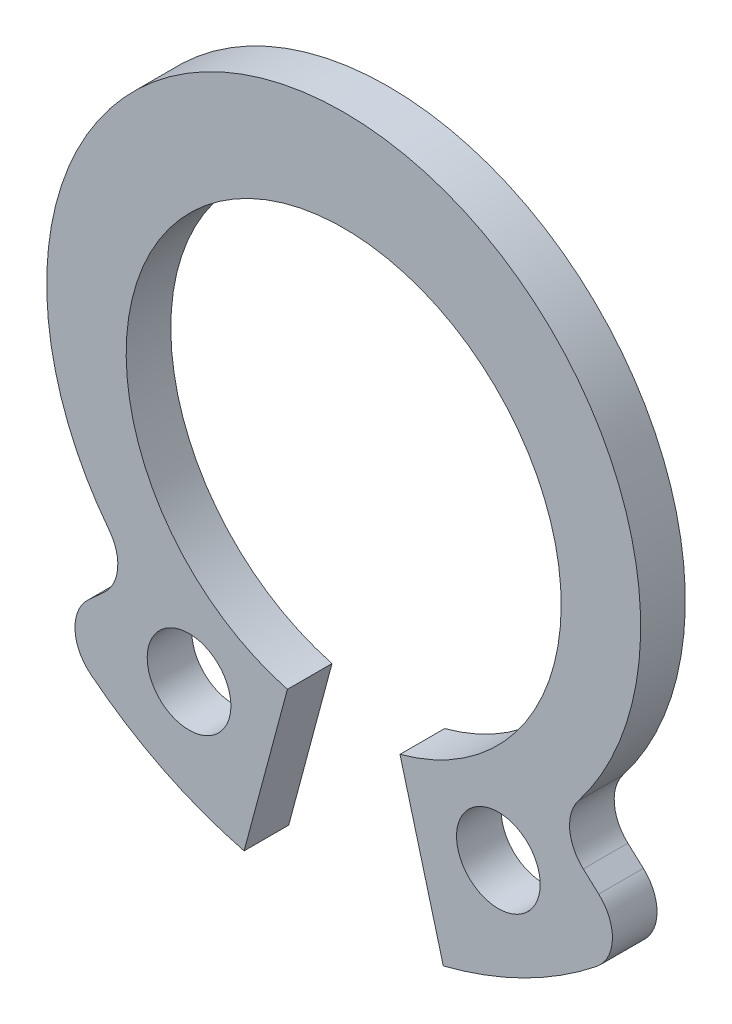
ISO-10303-21;
HEADER;
FILE_DESCRIPTION(('STEP AP214'),'2;1');
FILE_NAME('part.step','',(''),(''),'','','');
FILE_SCHEMA(('AUTOMOTIVE_DESIGN { 1 0 10303 214 1 1 1 1 }'));
ENDSEC;
DATA;
#1=APPLICATION_CONTEXT('core data for automotive mechanical design processes');
#2=APPLICATION_PROTOCOL_DEFINITION('international standard','automotive_design',2000,#1);
#3=PRODUCT_CONTEXT('',#1,'mechanical');
#4=PRODUCT('Part','Part','',(#3));
#5=PRODUCT_RELATED_PRODUCT_CATEGORY('part','',(#4));
#6=PRODUCT_DEFINITION_FORMATION('','',#4);
#7=PRODUCT_DEFINITION_CONTEXT('part definition',#1,'design');
#8=PRODUCT_DEFINITION('design','',#6,#7);
#9=PRODUCT_DEFINITION_SHAPE('','',#8);
#10=(LENGTH_UNIT() NAMED_UNIT(*) SI_UNIT(.MILLI.,.METRE.));
#11=(NAMED_UNIT(*) PLANE_ANGLE_UNIT() SI_UNIT($,.RADIAN.));
#12=(NAMED_UNIT(*) SI_UNIT($,.STERADIAN.) SOLID_ANGLE_UNIT());
#13=UNCERTAINTY_MEASURE_WITH_UNIT(LENGTH_MEASURE(1.E-05),#10,'distance_accuracy_value','');
#14=(GEOMETRIC_REPRESENTATION_CONTEXT(3) GLOBAL_UNCERTAINTY_ASSIGNED_CONTEXT((#13)) GLOBAL_UNIT_ASSIGNED_CONTEXT((#10,
#11,#12)) REPRESENTATION_CONTEXT('',''));
#15=CARTESIAN_POINT('',(0.,0.,0.));
#16=DIRECTION('',(0.,0.,1.));
#17=DIRECTION('',(1.,0.,0.));
#18=AXIS2_PLACEMENT_3D('',#15,#16,#17);
#19=CARTESIAN_POINT('',(-4.79991390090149,-3.34876846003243,0.799999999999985));
#20=DIRECTION('',(0.,0.,-1.));
#21=DIRECTION('',(-1.,0.,0.));
#22=AXIS2_PLACEMENT_3D('',#19,#20,#21);
#23=PLANE('',#22);
#24=CARTESIAN_POINT('',(2.77313372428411,-4.53181244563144,0.799999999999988));
#25=DIRECTION('',(0.,0.,1.));
#26=DIRECTION('',(1.,0.,0.));
#27=AXIS2_PLACEMENT_3D('',#24,#25,#26);
#28=CIRCLE('',#27,0.75);
#29=CARTESIAN_POINT('',(3.52313372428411,-4.53181244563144,0.799999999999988));
#30=VERTEX_POINT('',#29);
#31=EDGE_CURVE('E139',#30,#30,#28,.T.);
#32=ORIENTED_EDGE('',*,*,#31,.F.);
#33=EDGE_LOOP('',(#32));
#34=FACE_BOUND('',#33,.T.);
#35=CARTESIAN_POINT('',(-4.79991390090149,-3.34876846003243,0.799999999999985));
#36=DIRECTION('',(0.,0.,-1.));
#37=DIRECTION('',(-1.,0.,0.));
#38=AXIS2_PLACEMENT_3D('',#35,#36,#37);
#39=CIRCLE('',#38,0.750000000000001);
#40=CARTESIAN_POINT('',(-4.20733193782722,-2.88904395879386,0.799999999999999));
#41=VERTEX_POINT('',#40);
#42=CARTESIAN_POINT('',(-4.29549378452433,-3.90380030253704,0.799999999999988));
#43=VERTEX_POINT('',#42);
#44=EDGE_CURVE('E165',#41,#43,#39,.T.);
#45=ORIENTED_EDGE('',*,*,#44,.T.);
#46=DIRECTION('',(-0.740042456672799,-0.672560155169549,0.));
#47=VECTOR('',#46,1.);
#48=CARTESIAN_POINT('',(-4.29549378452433,-3.90380030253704,0.799999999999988));
#49=LINE('',#48,#47);
#50=CARTESIAN_POINT('',(-4.5727932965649,-4.15581368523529,0.799999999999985));
#51=VERTEX_POINT('',#50);
#52=EDGE_CURVE('E134',#43,#51,#49,.T.);
#53=ORIENTED_EDGE('',*,*,#52,.T.);
#54=CARTESIAN_POINT('',(-4.06837318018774,-4.7108455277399,0.799999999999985));
#55=DIRECTION('',(0.,0.,1.));
#56=DIRECTION('',(-1.,0.,0.));
#57=AXIS2_PLACEMENT_3D('',#54,#55,#56);
#58=CIRCLE('',#57,0.75);
#59=CARTESIAN_POINT('',(-4.53687317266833,-5.29651416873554,0.799999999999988));
#60=VERTEX_POINT('',#59);
#61=EDGE_CURVE('E168',#51,#60,#58,.T.);
#62=ORIENTED_EDGE('',*,*,#61,.T.);
#63=CARTESIAN_POINT('',(0.,0.375000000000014,0.799999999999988));
#64=DIRECTION('',(0.,0.,1.));
#65=DIRECTION('',(1.,0.,0.));
#66=AXIS2_PLACEMENT_3D('',#63,#64,#65);
#67=CIRCLE('',#66,7.26287072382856);
#68=CARTESIAN_POINT('',(-1.78585141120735,-6.66488820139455,0.799999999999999));
#69=VERTEX_POINT('',#68);
#70=EDGE_CURVE('E170',#60,#69,#67,.T.);
#71=ORIENTED_EDGE('',*,*,#70,.T.);
#72=DIRECTION('',(0.258819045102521,0.965925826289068,0.));
#73=VECTOR('',#72,1.);
#74=CARTESIAN_POINT('',(-1.00939427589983,-3.76711072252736,0.799999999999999));
#75=LINE('',#74,#73);
#76=CARTESIAN_POINT('',(-1.00939427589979,-3.76711072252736,0.799999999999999));
#77=VERTEX_POINT('',#76);
#78=EDGE_CURVE('E172',#69,#77,#75,.T.);
#79=ORIENTED_EDGE('',*,*,#78,.T.);
#80=CARTESIAN_POINT('',(0.,0.,0.799999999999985));
#81=DIRECTION('',(0.,0.,-1.));
#82=DIRECTION('',(1.,0.,0.));
#83=AXIS2_PLACEMENT_3D('',#80,#81,#82);
#84=CIRCLE('',#83,3.9);
#85=CARTESIAN_POINT('',(1.00939427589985,-3.76711072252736,0.799999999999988));
#86=VERTEX_POINT('',#85);
#87=EDGE_CURVE('E174',#77,#86,#84,.T.);
#88=ORIENTED_EDGE('',*,*,#87,.T.);
#89=DIRECTION('',(0.258819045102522,-0.965925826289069,0.));
#90=VECTOR('',#89,1.);
#91=CARTESIAN_POINT('',(1.00939427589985,-3.76711072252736,0.799999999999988));
#92=LINE('',#91,#90);
#93=CARTESIAN_POINT('',(1.78585141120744,-6.66488820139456,0.799999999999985));
#94=VERTEX_POINT('',#93);
#95=EDGE_CURVE('E176',#86,#94,#92,.T.);
#96=ORIENTED_EDGE('',*,*,#95,.T.);
#97=CARTESIAN_POINT('',(0.,0.375000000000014,0.799999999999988));
#98=DIRECTION('',(0.,0.,1.));
#99=DIRECTION('',(1.,0.,0.));
#100=AXIS2_PLACEMENT_3D('',#97,#98,#99);
#101=CIRCLE('',#100,7.26287072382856);
#102=CARTESIAN_POINT('',(4.53687317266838,-5.29651416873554,0.799999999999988));
#103=VERTEX_POINT('',#102);
#104=EDGE_CURVE('E178',#94,#103,#101,.T.);
#105=ORIENTED_EDGE('',*,*,#104,.T.);
#106=CARTESIAN_POINT('',(4.06837318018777,-4.7108455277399,0.799999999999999));
#107=DIRECTION('',(0.,0.,1.));
#108=DIRECTION('',(1.,0.,0.));
#109=AXIS2_PLACEMENT_3D('',#106,#107,#108);
#110=CIRCLE('',#109,0.75);
#111=CARTESIAN_POINT('',(4.57279329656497,-4.15581368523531,0.799999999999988));
#112=VERTEX_POINT('',#111);
#113=EDGE_CURVE('E180',#103,#112,#110,.T.);
#114=ORIENTED_EDGE('',*,*,#113,.T.);
#115=DIRECTION('',(-0.7400424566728,0.67256015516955,0.));
#116=VECTOR('',#115,1.);
#117=CARTESIAN_POINT('',(4.29549378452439,-3.90380030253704,0.799999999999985));
#118=LINE('',#117,#116);
#119=CARTESIAN_POINT('',(4.29549378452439,-3.90380030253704,0.799999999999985));
#120=VERTEX_POINT('',#119);
#121=EDGE_CURVE('E182',#112,#120,#118,.T.);
#122=ORIENTED_EDGE('',*,*,#121,.T.);
#123=CARTESIAN_POINT('',(4.79991390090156,-3.34876846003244,0.799999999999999));
#124=DIRECTION('',(0.,0.,-1.));
#125=DIRECTION('',(1.,0.,0.));
#126=AXIS2_PLACEMENT_3D('',#123,#124,#125);
#127=CIRCLE('',#126,0.750000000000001);
#128=CARTESIAN_POINT('',(4.20733193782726,-2.88904395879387,0.799999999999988));
#129=VERTEX_POINT('',#128);
#130=EDGE_CURVE('E51',#120,#129,#127,.T.);
#131=ORIENTED_EDGE('',*,*,#130,.T.);
#132=CARTESIAN_POINT('',(0.,0.375000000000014,0.799999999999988));
#133=DIRECTION('',(0.,0.,1.));
#134=DIRECTION('',(1.,0.,0.));
#135=AXIS2_PLACEMENT_3D('',#132,#133,#134);
#136=CIRCLE('',#135,5.325);
#137=EDGE_CURVE('E46',#129,#41,#136,.T.);
#138=ORIENTED_EDGE('',*,*,#137,.T.);
#139=EDGE_LOOP('',(#45,#53,#62,#71,#79,#88,#96,#105,#114,#122,#131,#138));
#140=FACE_BOUND('',#139,.T.);
#141=CARTESIAN_POINT('',(-2.77313372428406,-4.53181244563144,0.799999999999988));
#142=DIRECTION('',(0.,0.,1.));
#143=DIRECTION('',(-1.,0.,0.));
#144=AXIS2_PLACEMENT_3D('',#141,#142,#143);
#145=CIRCLE('',#144,0.75);
#146=CARTESIAN_POINT('',(-3.52313372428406,-4.53181244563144,0.799999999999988));
#147=VERTEX_POINT('',#146);
#148=EDGE_CURVE('E285',#147,#147,#145,.T.);
#149=ORIENTED_EDGE('',*,*,#148,.F.);
#150=EDGE_LOOP('',(#149));
#151=FACE_BOUND('',#150,.T.);
#152=ADVANCED_FACE('F31',(#34,#140,#151),#23,.F.);
#153=CARTESIAN_POINT('',(-4.79991390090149,-3.34876846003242,0.));
#154=DIRECTION('',(0.,0.,-1.));
#155=DIRECTION('',(-1.,0.,0.));
#156=AXIS2_PLACEMENT_3D('',#153,#154,#155);
#157=PLANE('',#156);
#158=CARTESIAN_POINT('',(2.7731337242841,-4.53181244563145,0.));
#159=DIRECTION('',(0.,0.,1.));
#160=DIRECTION('',(1.,0.,0.));
#161=AXIS2_PLACEMENT_3D('',#158,#159,#160);
#162=CIRCLE('',#161,0.75);
#163=CARTESIAN_POINT('',(3.5231337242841,-4.53181244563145,0.));
#164=VERTEX_POINT('',#163);
#165=EDGE_CURVE('E142',#164,#164,#162,.T.);
#166=ORIENTED_EDGE('',*,*,#165,.T.);
#167=EDGE_LOOP('',(#166));
#168=FACE_BOUND('',#167,.T.);
#169=CARTESIAN_POINT('',(-4.79991390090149,-3.34876846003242,0.));
#170=DIRECTION('',(0.,0.,-1.));
#171=DIRECTION('',(-1.,0.,0.));
#172=AXIS2_PLACEMENT_3D('',#169,#170,#171);
#173=CIRCLE('',#172,0.750000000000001);
#174=CARTESIAN_POINT('',(-4.20733193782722,-2.88904395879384,0.));
#175=VERTEX_POINT('',#174);
#176=CARTESIAN_POINT('',(-4.29549378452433,-3.90380030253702,0.));
#177=VERTEX_POINT('',#176);
#178=EDGE_CURVE('E125',#175,#177,#173,.T.);
#179=ORIENTED_EDGE('',*,*,#178,.F.);
#180=CARTESIAN_POINT('',(0.,0.375000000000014,0.));
#181=DIRECTION('',(0.,0.,1.));
#182=DIRECTION('',(1.,0.,0.));
#183=AXIS2_PLACEMENT_3D('',#180,#181,#182);
#184=CIRCLE('',#183,5.325);
#185=CARTESIAN_POINT('',(4.20733193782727,-2.88904395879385,0.));
#186=VERTEX_POINT('',#185);
#187=EDGE_CURVE('E163',#186,#175,#184,.T.);
#188=ORIENTED_EDGE('',*,*,#187,.F.);
#189=CARTESIAN_POINT('',(4.79991390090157,-3.34876846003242,0.));
#190=DIRECTION('',(0.,0.,-1.));
#191=DIRECTION('',(1.,0.,0.));
#192=AXIS2_PLACEMENT_3D('',#189,#190,#191);
#193=CIRCLE('',#192,0.750000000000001);
#194=CARTESIAN_POINT('',(4.29549378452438,-3.90380030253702,0.));
#195=VERTEX_POINT('',#194);
#196=EDGE_CURVE('E161',#195,#186,#193,.T.);
#197=ORIENTED_EDGE('',*,*,#196,.F.);
#198=DIRECTION('',(-0.7400424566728,0.67256015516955,0.));
#199=VECTOR('',#198,1.);
#200=CARTESIAN_POINT('',(4.29549378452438,-3.90380030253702,0.));
#201=LINE('',#200,#199);
#202=CARTESIAN_POINT('',(4.57279329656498,-4.1558136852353,0.));
#203=VERTEX_POINT('',#202);
#204=EDGE_CURVE('E159',#203,#195,#201,.T.);
#205=ORIENTED_EDGE('',*,*,#204,.F.);
#206=CARTESIAN_POINT('',(4.06837318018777,-4.7108455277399,0.));
#207=DIRECTION('',(0.,0.,1.));
#208=DIRECTION('',(1.,0.,0.));
#209=AXIS2_PLACEMENT_3D('',#206,#207,#208);
#210=CIRCLE('',#209,0.75);
#211=CARTESIAN_POINT('',(4.53687317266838,-5.29651416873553,0.));
#212=VERTEX_POINT('',#211);
#213=EDGE_CURVE('E157',#212,#203,#210,.T.);
#214=ORIENTED_EDGE('',*,*,#213,.F.);
#215=CARTESIAN_POINT('',(0.,0.375000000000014,0.));
#216=DIRECTION('',(0.,0.,1.));
#217=DIRECTION('',(1.,0.,0.));
#218=AXIS2_PLACEMENT_3D('',#215,#216,#217);
#219=CIRCLE('',#218,7.26287072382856);
#220=CARTESIAN_POINT('',(1.78585141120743,-6.66488820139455,0.));
#221=VERTEX_POINT('',#220);
#222=EDGE_CURVE('E155',#221,#212,#219,.T.);
#223=ORIENTED_EDGE('',*,*,#222,.F.);
#224=DIRECTION('',(0.258819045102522,-0.965925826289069,0.));
#225=VECTOR('',#224,1.);
#226=CARTESIAN_POINT('',(1.00939427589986,-3.76711072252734,0.));
#227=LINE('',#226,#225);
#228=CARTESIAN_POINT('',(1.00939427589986,-3.76711072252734,0.));
#229=VERTEX_POINT('',#228);
#230=EDGE_CURVE('E153',#229,#221,#227,.T.);
#231=ORIENTED_EDGE('',*,*,#230,.F.);
#232=CARTESIAN_POINT('',(0.,0.,0.));
#233=DIRECTION('',(0.,0.,-1.));
#234=DIRECTION('',(1.,0.,0.));
#235=AXIS2_PLACEMENT_3D('',#232,#233,#234);
#236=CIRCLE('',#235,3.9);
#237=CARTESIAN_POINT('',(-1.00939427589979,-3.76711072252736,0.));
#238=VERTEX_POINT('',#237);
#239=EDGE_CURVE('E151',#238,#229,#236,.T.);
#240=ORIENTED_EDGE('',*,*,#239,.F.);
#241=DIRECTION('',(0.258819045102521,0.965925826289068,0.));
#242=VECTOR('',#241,1.);
#243=CARTESIAN_POINT('',(-1.00939427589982,-3.76711072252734,0.));
#244=LINE('',#243,#242);
#245=CARTESIAN_POINT('',(-1.78585141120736,-6.66488820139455,0.));
#246=VERTEX_POINT('',#245);
#247=EDGE_CURVE('E149',#246,#238,#244,.T.);
#248=ORIENTED_EDGE('',*,*,#247,.F.);
#249=CARTESIAN_POINT('',(0.,0.375000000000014,0.));
#250=DIRECTION('',(0.,0.,1.));
#251=DIRECTION('',(1.,0.,0.));
#252=AXIS2_PLACEMENT_3D('',#249,#250,#251);
#253=CIRCLE('',#252,7.26287072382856);
#254=CARTESIAN_POINT('',(-4.53687317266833,-5.29651416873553,0.));
#255=VERTEX_POINT('',#254);
#256=EDGE_CURVE('E147',#255,#246,#253,.T.);
#257=ORIENTED_EDGE('',*,*,#256,.F.);
#258=CARTESIAN_POINT('',(-4.06837318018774,-4.7108455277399,0.));
#259=DIRECTION('',(0.,0.,1.));
#260=DIRECTION('',(-1.,0.,0.));
#261=AXIS2_PLACEMENT_3D('',#258,#259,#260);
#262=CIRCLE('',#261,0.75);
#263=CARTESIAN_POINT('',(-4.5727932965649,-4.15581368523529,0.));
#264=VERTEX_POINT('',#263);
#265=EDGE_CURVE('E127',#264,#255,#262,.T.);
#266=ORIENTED_EDGE('',*,*,#265,.F.);
#267=DIRECTION('',(-0.740042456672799,-0.672560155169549,0.));
#268=VECTOR('',#267,1.);
#269=CARTESIAN_POINT('',(-4.29549378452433,-3.90380030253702,0.));
#270=LINE('',#269,#268);
#271=EDGE_CURVE('E120',#177,#264,#270,.T.);
#272=ORIENTED_EDGE('',*,*,#271,.F.);
#273=EDGE_LOOP('',(#179,#188,#197,#205,#214,#223,#231,#240,#248,#257,#266,#272));
#274=FACE_BOUND('',#273,.T.);
#275=CARTESIAN_POINT('',(-2.77313372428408,-4.53181244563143,0.));
#276=DIRECTION('',(0.,0.,1.));
#277=DIRECTION('',(-1.,0.,0.));
#278=AXIS2_PLACEMENT_3D('',#275,#276,#277);
#279=CIRCLE('',#278,0.75);
#280=CARTESIAN_POINT('',(-3.52313372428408,-4.53181244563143,0.));
#281=VERTEX_POINT('',#280);
#282=EDGE_CURVE('E288',#281,#281,#279,.T.);
#283=ORIENTED_EDGE('',*,*,#282,.T.);
#284=EDGE_LOOP('',(#283));
#285=FACE_BOUND('',#284,.T.);
#286=ADVANCED_FACE('F121',(#168,#274,#285),#157,.T.);
#287=CARTESIAN_POINT('',(-4.79991390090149,-3.34876846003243,0.799999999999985));
#288=DIRECTION('',(0.,0.,-1.));
#289=DIRECTION('',(-1.,0.,0.));
#290=AXIS2_PLACEMENT_3D('',#287,#288,#289);
#291=CYLINDRICAL_SURFACE('',#290,0.750000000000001);
#292=ORIENTED_EDGE('',*,*,#178,.T.);
#293=DIRECTION('',(0.,0.,-1.));
#294=VECTOR('',#293,1.);
#295=CARTESIAN_POINT('',(-4.29549378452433,-3.90380030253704,0.799999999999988));
#296=LINE('',#295,#294);
#297=EDGE_CURVE('E11',#43,#177,#296,.T.);
#298=ORIENTED_EDGE('',*,*,#297,.F.);
#299=ORIENTED_EDGE('',*,*,#44,.F.);
#300=DIRECTION('',(0.,0.,-1.));
#301=VECTOR('',#300,1.);
#302=CARTESIAN_POINT('',(-4.20733193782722,-2.88904395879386,0.799999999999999));
#303=LINE('',#302,#301);
#304=EDGE_CURVE('E138',#41,#175,#303,.T.);
#305=ORIENTED_EDGE('',*,*,#304,.T.);
#306=EDGE_LOOP('',(#292,#298,#299,#305));
#307=FACE_BOUND('',#306,.T.);
#308=ADVANCED_FACE('F33',(#307),#291,.F.);
#309=CARTESIAN_POINT('',(-4.29549378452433,-3.90380030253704,0.799999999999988));
#310=DIRECTION('',(0.67256015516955,-0.7400424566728,0.));
#311=DIRECTION('',(0.740042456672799,0.672560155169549,0.));
#312=AXIS2_PLACEMENT_3D('',#309,#310,#311);
#313=PLANE('',#312);
#314=ORIENTED_EDGE('',*,*,#271,.T.);
#315=DIRECTION('',(0.,0.,-1.));
#316=VECTOR('',#315,1.);
#317=CARTESIAN_POINT('',(-4.5727932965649,-4.15581368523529,0.799999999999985));
#318=LINE('',#317,#316);
#319=EDGE_CURVE('E39',#51,#264,#318,.T.);
#320=ORIENTED_EDGE('',*,*,#319,.F.);
#321=ORIENTED_EDGE('',*,*,#52,.F.);
#322=ORIENTED_EDGE('',*,*,#297,.T.);
#323=EDGE_LOOP('',(#314,#320,#321,#322));
#324=FACE_BOUND('',#323,.T.);
#325=ADVANCED_FACE('F133',(#324),#313,.F.);
#326=CARTESIAN_POINT('',(-4.06837318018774,-4.7108455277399,0.799999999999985));
#327=DIRECTION('',(0.,0.,-1.));
#328=DIRECTION('',(-1.,0.,0.));
#329=AXIS2_PLACEMENT_3D('',#326,#327,#328);
#330=CYLINDRICAL_SURFACE('',#329,0.75);
#331=ORIENTED_EDGE('',*,*,#265,.T.);
#332=DIRECTION('',(0.,0.,-1.));
#333=VECTOR('',#332,1.);
#334=CARTESIAN_POINT('',(-4.53687317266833,-5.29651416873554,0.799999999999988));
#335=LINE('',#334,#333);
#336=EDGE_CURVE('E211',#60,#255,#335,.T.);
#337=ORIENTED_EDGE('',*,*,#336,.F.);
#338=ORIENTED_EDGE('',*,*,#61,.F.);
#339=ORIENTED_EDGE('',*,*,#319,.T.);
#340=EDGE_LOOP('',(#331,#337,#338,#339));
#341=FACE_BOUND('',#340,.T.);
#342=ADVANCED_FACE('F215',(#341),#330,.T.);
#343=CARTESIAN_POINT('',(0.,0.375000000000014,0.799999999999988));
#344=DIRECTION('',(0.,0.,-1.));
#345=DIRECTION('',(-1.,0.,0.));
#346=AXIS2_PLACEMENT_3D('',#343,#344,#345);
#347=CYLINDRICAL_SURFACE('',#346,7.26287072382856);
#348=ORIENTED_EDGE('',*,*,#256,.T.);
#349=DIRECTION('',(0.,0.,-1.));
#350=VECTOR('',#349,1.);
#351=CARTESIAN_POINT('',(-1.78585141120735,-6.66488820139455,0.799999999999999));
#352=LINE('',#351,#350);
#353=EDGE_CURVE('E208',#69,#246,#352,.T.);
#354=ORIENTED_EDGE('',*,*,#353,.F.);
#355=ORIENTED_EDGE('',*,*,#70,.F.);
#356=ORIENTED_EDGE('',*,*,#336,.T.);
#357=EDGE_LOOP('',(#348,#354,#355,#356));
#358=FACE_BOUND('',#357,.T.);
#359=ADVANCED_FACE('F223',(#358),#347,.T.);
#360=CARTESIAN_POINT('',(-1.00939427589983,-3.76711072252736,0.799999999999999));
#361=DIRECTION('',(-0.965925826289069,0.258819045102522,0.));
#362=DIRECTION('',(-0.258819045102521,-0.965925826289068,0.));
#363=AXIS2_PLACEMENT_3D('',#360,#361,#362);
#364=PLANE('',#363);
#365=ORIENTED_EDGE('',*,*,#247,.T.);
#366=DIRECTION('',(0.,0.,-1.));
#367=VECTOR('',#366,1.);
#368=CARTESIAN_POINT('',(-1.00939427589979,-3.76711072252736,0.799999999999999));
#369=LINE('',#368,#367);
#370=EDGE_CURVE('E205',#77,#238,#369,.T.);
#371=ORIENTED_EDGE('',*,*,#370,.F.);
#372=ORIENTED_EDGE('',*,*,#78,.F.);
#373=ORIENTED_EDGE('',*,*,#353,.T.);
#374=EDGE_LOOP('',(#365,#371,#372,#373));
#375=FACE_BOUND('',#374,.T.);
#376=ADVANCED_FACE('F226',(#375),#364,.F.);
#377=CARTESIAN_POINT('',(0.,0.,0.799999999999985));
#378=DIRECTION('',(0.,0.,-1.));
#379=DIRECTION('',(-1.,0.,0.));
#380=AXIS2_PLACEMENT_3D('',#377,#378,#379);
#381=CYLINDRICAL_SURFACE('',#380,3.9);
#382=ORIENTED_EDGE('',*,*,#239,.T.);
#383=DIRECTION('',(0.,0.,-1.));
#384=VECTOR('',#383,1.);
#385=CARTESIAN_POINT('',(1.00939427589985,-3.76711072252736,0.799999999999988));
#386=LINE('',#385,#384);
#387=EDGE_CURVE('E202',#86,#229,#386,.T.);
#388=ORIENTED_EDGE('',*,*,#387,.F.);
#389=ORIENTED_EDGE('',*,*,#87,.F.);
#390=ORIENTED_EDGE('',*,*,#370,.T.);
#391=EDGE_LOOP('',(#382,#388,#389,#390));
#392=FACE_BOUND('',#391,.T.);
#393=ADVANCED_FACE('F231',(#392),#381,.F.);
#394=CARTESIAN_POINT('',(1.00939427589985,-3.76711072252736,0.799999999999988));
#395=DIRECTION('',(0.965925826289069,0.258819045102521,0.));
#396=DIRECTION('',(-0.258819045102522,0.965925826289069,0.));
#397=AXIS2_PLACEMENT_3D('',#394,#395,#396);
#398=PLANE('',#397);
#399=ORIENTED_EDGE('',*,*,#230,.T.);
#400=DIRECTION('',(0.,0.,-1.));
#401=VECTOR('',#400,1.);
#402=CARTESIAN_POINT('',(1.78585141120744,-6.66488820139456,0.799999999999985));
#403=LINE('',#402,#401);
#404=EDGE_CURVE('E199',#94,#221,#403,.T.);
#405=ORIENTED_EDGE('',*,*,#404,.F.);
#406=ORIENTED_EDGE('',*,*,#95,.F.);
#407=ORIENTED_EDGE('',*,*,#387,.T.);
#408=EDGE_LOOP('',(#399,#405,#406,#407));
#409=FACE_BOUND('',#408,.T.);
#410=ADVANCED_FACE('F237',(#409),#398,.F.);
#411=CARTESIAN_POINT('',(0.,0.375000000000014,0.799999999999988));
#412=DIRECTION('',(0.,0.,-1.));
#413=DIRECTION('',(-1.,0.,0.));
#414=AXIS2_PLACEMENT_3D('',#411,#412,#413);
#415=CYLINDRICAL_SURFACE('',#414,7.26287072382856);
#416=ORIENTED_EDGE('',*,*,#222,.T.);
#417=DIRECTION('',(0.,0.,-1.));
#418=VECTOR('',#417,1.);
#419=CARTESIAN_POINT('',(4.53687317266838,-5.29651416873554,0.799999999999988));
#420=LINE('',#419,#418);
#421=EDGE_CURVE('E196',#103,#212,#420,.T.);
#422=ORIENTED_EDGE('',*,*,#421,.F.);
#423=ORIENTED_EDGE('',*,*,#104,.F.);
#424=ORIENTED_EDGE('',*,*,#404,.T.);
#425=EDGE_LOOP('',(#416,#422,#423,#424));
#426=FACE_BOUND('',#425,.T.);
#427=ADVANCED_FACE('F241',(#426),#415,.T.);
#428=CARTESIAN_POINT('',(4.06837318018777,-4.7108455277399,0.799999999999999));
#429=DIRECTION('',(0.,0.,-1.));
#430=DIRECTION('',(-1.,0.,0.));
#431=AXIS2_PLACEMENT_3D('',#428,#429,#430);
#432=CYLINDRICAL_SURFACE('',#431,0.75);
#433=ORIENTED_EDGE('',*,*,#213,.T.);
#434=DIRECTION('',(0.,0.,-1.));
#435=VECTOR('',#434,1.);
#436=CARTESIAN_POINT('',(4.57279329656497,-4.15581368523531,0.799999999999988));
#437=LINE('',#436,#435);
#438=EDGE_CURVE('E193',#112,#203,#437,.T.);
#439=ORIENTED_EDGE('',*,*,#438,.F.);
#440=ORIENTED_EDGE('',*,*,#113,.F.);
#441=ORIENTED_EDGE('',*,*,#421,.T.);
#442=EDGE_LOOP('',(#433,#439,#440,#441));
#443=FACE_BOUND('',#442,.T.);
#444=ADVANCED_FACE('F246',(#443),#432,.T.);
#445=CARTESIAN_POINT('',(4.29549378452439,-3.90380030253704,0.799999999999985));
#446=DIRECTION('',(-0.672560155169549,-0.740042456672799,0.));
#447=DIRECTION('',(0.7400424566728,-0.67256015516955,0.));
#448=AXIS2_PLACEMENT_3D('',#445,#446,#447);
#449=PLANE('',#448);
#450=ORIENTED_EDGE('',*,*,#204,.T.);
#451=DIRECTION('',(0.,0.,-1.));
#452=VECTOR('',#451,1.);
#453=CARTESIAN_POINT('',(4.29549378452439,-3.90380030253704,0.799999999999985));
#454=LINE('',#453,#452);
#455=EDGE_CURVE('E190',#120,#195,#454,.T.);
#456=ORIENTED_EDGE('',*,*,#455,.F.);
#457=ORIENTED_EDGE('',*,*,#121,.F.);
#458=ORIENTED_EDGE('',*,*,#438,.T.);
#459=EDGE_LOOP('',(#450,#456,#457,#458));
#460=FACE_BOUND('',#459,.T.);
#461=ADVANCED_FACE('F250',(#460),#449,.F.);
#462=CARTESIAN_POINT('',(4.79991390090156,-3.34876846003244,0.799999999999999));
#463=DIRECTION('',(0.,0.,-1.));
#464=DIRECTION('',(-1.,0.,0.));
#465=AXIS2_PLACEMENT_3D('',#462,#463,#464);
#466=CYLINDRICAL_SURFACE('',#465,0.750000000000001);
#467=ORIENTED_EDGE('',*,*,#196,.T.);
#468=DIRECTION('',(0.,0.,-1.));
#469=VECTOR('',#468,1.);
#470=CARTESIAN_POINT('',(4.20733193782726,-2.88904395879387,0.799999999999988));
#471=LINE('',#470,#469);
#472=EDGE_CURVE('E187',#129,#186,#471,.T.);
#473=ORIENTED_EDGE('',*,*,#472,.F.);
#474=ORIENTED_EDGE('',*,*,#130,.F.);
#475=ORIENTED_EDGE('',*,*,#455,.T.);
#476=EDGE_LOOP('',(#467,#473,#474,#475));
#477=FACE_BOUND('',#476,.T.);
#478=ADVANCED_FACE('F254',(#477),#466,.F.);
#479=CARTESIAN_POINT('',(0.,0.375000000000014,0.799999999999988));
#480=DIRECTION('',(0.,0.,-1.));
#481=DIRECTION('',(-1.,0.,0.));
#482=AXIS2_PLACEMENT_3D('',#479,#480,#481);
#483=CYLINDRICAL_SURFACE('',#482,5.325);
#484=ORIENTED_EDGE('',*,*,#187,.T.);
#485=ORIENTED_EDGE('',*,*,#304,.F.);
#486=ORIENTED_EDGE('',*,*,#137,.F.);
#487=ORIENTED_EDGE('',*,*,#472,.T.);
#488=EDGE_LOOP('',(#484,#485,#486,#487));
#489=FACE_BOUND('',#488,.T.);
#490=ADVANCED_FACE('F256',(#489),#483,.T.);
#491=CARTESIAN_POINT('',(2.77313372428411,-4.53181244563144,0.799999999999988));
#492=DIRECTION('',(0.,0.,-1.));
#493=DIRECTION('',(-1.,0.,0.));
#494=AXIS2_PLACEMENT_3D('',#491,#492,#493);
#495=CYLINDRICAL_SURFACE('',#494,0.75);
#496=ORIENTED_EDGE('',*,*,#31,.T.);
#497=EDGE_LOOP('',(#496));
#498=FACE_BOUND('',#497,.T.);
#499=ORIENTED_EDGE('',*,*,#165,.F.);
#500=EDGE_LOOP('',(#499));
#501=FACE_BOUND('',#500,.T.);
#502=ADVANCED_FACE('F258',(#498,#501),#495,.F.);
#503=CARTESIAN_POINT('',(-2.77313372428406,-4.53181244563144,0.799999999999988));
#504=DIRECTION('',(0.,0.,-1.));
#505=DIRECTION('',(-1.,0.,0.));
#506=AXIS2_PLACEMENT_3D('',#503,#504,#505);
#507=CYLINDRICAL_SURFACE('',#506,0.75);
#508=ORIENTED_EDGE('',*,*,#148,.T.);
#509=EDGE_LOOP('',(#508));
#510=FACE_BOUND('',#509,.T.);
#511=ORIENTED_EDGE('',*,*,#282,.F.);
#512=EDGE_LOOP('',(#511));
#513=FACE_BOUND('',#512,.T.);
#514=ADVANCED_FACE('F264',(#510,#513),#507,.F.);
#515=CLOSED_SHELL('',(#152,#286,#308,#325,#342,#359,#376,#393,#410,#427,#444,#461,#478,#490,
#502,#514));
#516=MANIFOLD_SOLID_BREP('B2',#515);
#517=ADVANCED_BREP_SHAPE_REPRESENTATION('',(#18,#516),#14);
#518=SHAPE_DEFINITION_REPRESENTATION(#9,#517);
ENDSEC;
END-ISO-10303-21;
